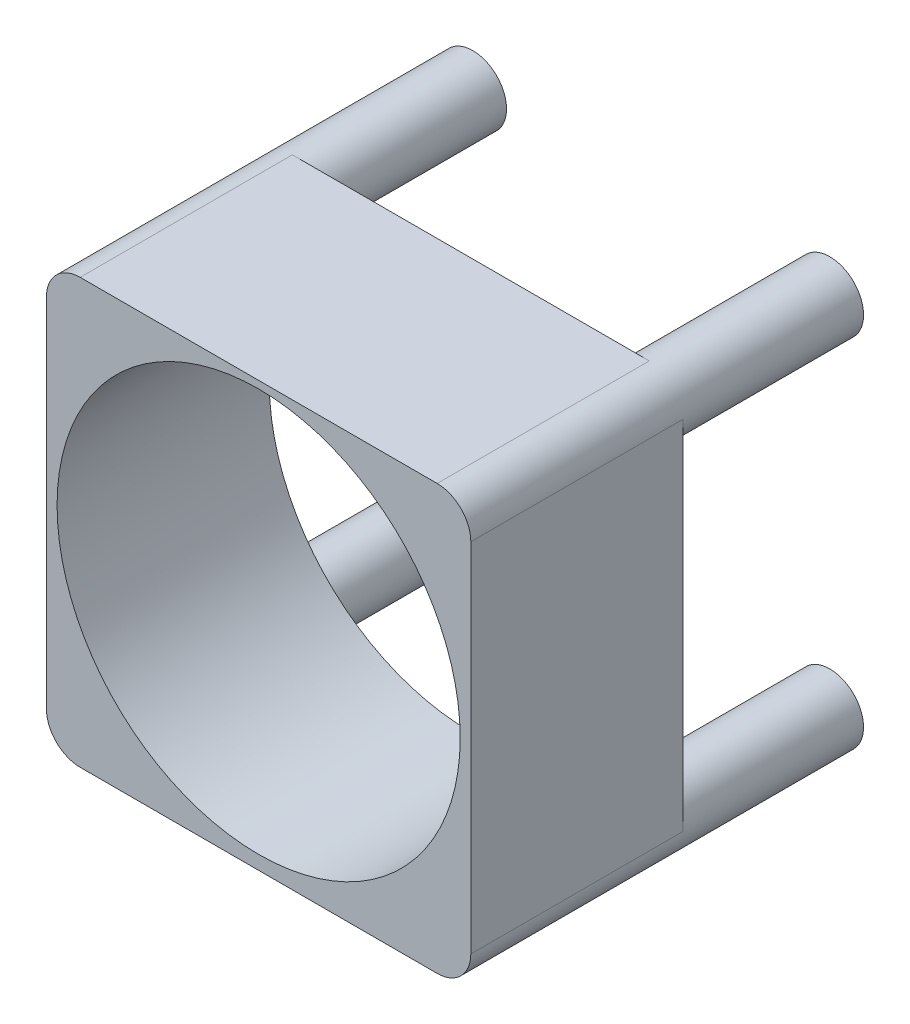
from build123d import *

# Parameters (mm, degrees)
BASE_EXTRUDE_DEPTH  = 20
SKETCH2_R           = 19
CUT_EXTRUDE1_DEPTH  = 61
BOSS_EXTRUDE1_START = 17.018
SKETCH3_R           = 3.175
BOSS_EXTRUDE1_DEPTH = 17.018


with BuildPart() as part:
    # Sketch1 → Base-Extrude (new body)
    with BuildSketch(Plane.XY):
        with BuildLine():
            Line((3.175, 0), (36.825, 0))
            ThreePointArc((36.825, 0), (39.07006403, 0.92993597), (40, 3.175))
            Line((40, 3.175), (40, 36.825))
            ThreePointArc((40, 36.825), (39.07006403, 39.07006403), (36.825, 40))
            Line((36.825, 40), (3.175, 40))
            ThreePointArc((3.175, 40), (0.92993597, 39.07006403), (0, 36.825))
            Line((0, 36.825), (0, 3.175))
            ThreePointArc((0, 3.175), (0.92993597, 0.92993597), (3.175, 0))
        make_face()
    extrude(amount=BASE_EXTRUDE_DEPTH)

    # Sketch2 → Cut-Extrude1 (cut, through all)
    with BuildSketch(Plane.XY.offset(20)):
        with Locations((20, 20.302637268)):
            Circle(SKETCH2_R)
    extrude(amount=-CUT_EXTRUDE1_DEPTH, mode=Mode.SUBTRACT)

    # Sketch3 → Boss-Extrude1 (add)
    with BuildSketch(Plane(origin=(0, 0, 0), x_dir=(-1, 0, 0), z_dir=(0, 0, -1)).offset(BOSS_EXTRUDE1_START)):
        with Locations((-3.175, 36.825)):
            Circle(SKETCH3_R)
        with Locations(Location((-36.825, 36.825, 0), (0, 0, 180))):
            Circle(SKETCH3_R)
        with Locations((-3.175, 3.175)):
            Circle(SKETCH3_R)
        with Locations((-36.825, 3.175)):
            Circle(SKETCH3_R)
    extrude(amount=-BOSS_EXTRUDE1_DEPTH)


solid = part.part
